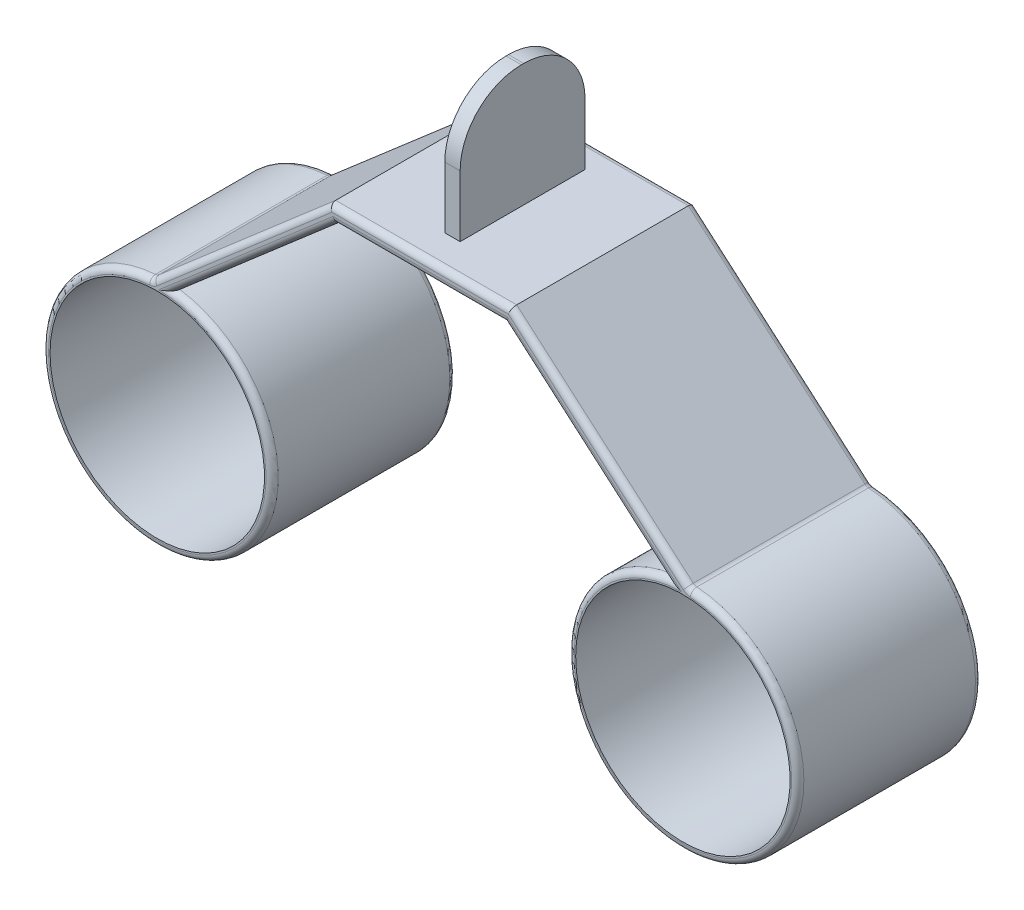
from build123d import *

# Parameters (mm, degrees)
SKETCH1_R           = 47.625
SKETCH1_R_2         = 44.45
BOSS_EXTRUDE1_DEPTH = 76.2
BOSS_EXTRUDE2_DEPTH = 76.2
FILLET1_R           = 2.54
SKETCH3_W           = 6.35
SKETCH3_H           = 51.786764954
BOSS_EXTRUDE3_DEPTH = 50.8
FILLET2_R           = 25.4


with BuildPart() as part:
    # Sketch1 → Boss-Extrude1 (new body)
    with BuildSketch(Plane.XY):
        with Locations(Location((108.9406, 0, 0), (0, 0, 180))):
            Circle(SKETCH1_R)
        with Locations(Location((108.9406, 0, 0), (0, 0, 180))):
            Circle(SKETCH1_R_2, mode=Mode.SUBTRACT)
    boss_extrude1 = extrude(amount=BOSS_EXTRUDE1_DEPTH)

    # Sketch2 → Boss-Extrude2 (add)
    with BuildSketch(Plane.XY.offset(76.2)):
        Polygon((111.377881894, 47.562593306), (37.520474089, 111.442494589), (0, 111.442494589), (0, 105.092494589), (35.155346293, 105.092494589), (102.15976529, 47.139801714), (102.15976529, 46.144818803), (111.377881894, 46.144818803), align=None)
    boss_extrude2 = extrude(amount=-BOSS_EXTRUDE2_DEPTH)

    # Mirror1: Boss-Extrude2 across plane
    add(boss_extrude2.mirror(Plane(origin=(0, 0, 0), x_dir=(0, 0, 1), z_dir=(1, 0, 0))))

    # Mirror2: Boss-Extrude1 across plane
    add(boss_extrude1.mirror(Plane(origin=(0, 0, 0), x_dir=(0, 0, 1), z_dir=(1, 0, 0))))

    # Fillet1
    fillet1_edges = [part.edges().sort_by_distance(p)[0] for p in [
        (111.122640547, -47.574986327, 0),
        (111.377881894, 47.562593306, 38.1),
        (68.657555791, 76.116148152, 0),
        (0, 105.092494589, 0),
        (0, 111.442494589, 0),
        (74.449177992, 79.502543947, 0),
        (74.449177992, 79.502543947, 76.2),
        (0, 111.442494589, 76.2),
        (0, 105.092494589, 76.2),
        (68.657555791, 76.116148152, 76.2),
        (-74.449177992, 79.502543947, 76.2),
        (-111.377881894, 47.562593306, 38.1),
        (-68.657555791, 76.116148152, 76.2),
        (-74.449177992, 79.502543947, 0),
        (-68.657555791, 76.116148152, 0),
        (-111.122640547, -47.574986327, 76.2),
        (-111.122640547, -47.574986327, 0),
        (111.122640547, -47.574986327, 76.2),
    ]]
    fillet(fillet1_edges, radius=FILLET1_R)

    # Sketch3 → Boss-Extrude3 (add)
    with BuildSketch(Plane(origin=(0, 111.442494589, 0), x_dir=(1, 0, 0), z_dir=(0, 1, 0))):
        with Locations((-0.055474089, -36.83)):
            Rectangle(SKETCH3_W, SKETCH3_H)
    extrude(amount=BOSS_EXTRUDE3_DEPTH)

    # Fillet2
    fillet2_edges = [part.edges().sort_by_distance(p)[0] for p in [
        (-0.055474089, 162.242494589, 62.723382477),
        (-0.055474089, 162.242494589, 10.936617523),
    ]]
    fillet(fillet2_edges, radius=FILLET2_R)


solid = part.part
